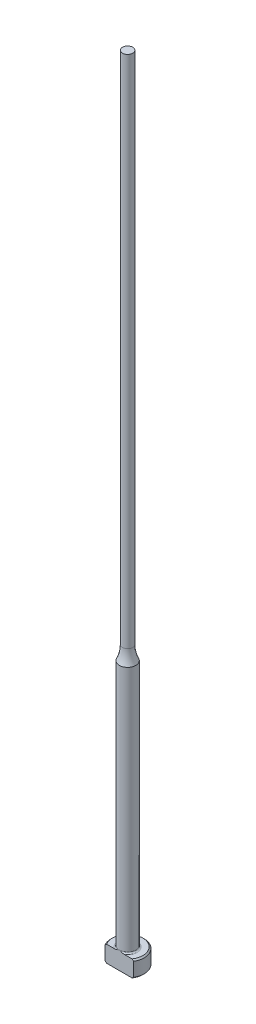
ISO-10303-21;
HEADER;
FILE_DESCRIPTION(('STEP AP214'),'2;1');
FILE_NAME('part.step','',(''),(''),'','','');
FILE_SCHEMA(('AUTOMOTIVE_DESIGN { 1 0 10303 214 1 1 1 1 }'));
ENDSEC;
DATA;
#1=APPLICATION_CONTEXT('core data for automotive mechanical design processes');
#2=APPLICATION_PROTOCOL_DEFINITION('international standard','automotive_design',2000,#1);
#3=PRODUCT_CONTEXT('',#1,'mechanical');
#4=PRODUCT('Part','Part','',(#3));
#5=PRODUCT_RELATED_PRODUCT_CATEGORY('part','',(#4));
#6=PRODUCT_DEFINITION_FORMATION('','',#4);
#7=PRODUCT_DEFINITION_CONTEXT('part definition',#1,'design');
#8=PRODUCT_DEFINITION('design','',#6,#7);
#9=PRODUCT_DEFINITION_SHAPE('','',#8);
#10=(LENGTH_UNIT() NAMED_UNIT(*) SI_UNIT(.MILLI.,.METRE.));
#11=(NAMED_UNIT(*) PLANE_ANGLE_UNIT() SI_UNIT($,.RADIAN.));
#12=(NAMED_UNIT(*) SI_UNIT($,.STERADIAN.) SOLID_ANGLE_UNIT());
#13=UNCERTAINTY_MEASURE_WITH_UNIT(LENGTH_MEASURE(1.E-05),#10,'distance_accuracy_value','');
#14=(GEOMETRIC_REPRESENTATION_CONTEXT(3) GLOBAL_UNCERTAINTY_ASSIGNED_CONTEXT((#13)) GLOBAL_UNIT_ASSIGNED_CONTEXT((#10,
#11,#12)) REPRESENTATION_CONTEXT('',''));
#15=CARTESIAN_POINT('',(0.,0.,0.));
#16=DIRECTION('',(0.,0.,1.));
#17=DIRECTION('',(1.,0.,0.));
#18=AXIS2_PLACEMENT_3D('',#15,#16,#17);
#19=CARTESIAN_POINT('',(-0.991869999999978,152.4,0.));
#20=DIRECTION('',(0.,1.,0.));
#21=DIRECTION('',(0.,0.,1.));
#22=AXIS2_PLACEMENT_3D('',#19,#20,#21);
#23=PLANE('',#22);
#24=CARTESIAN_POINT('',(0.,152.4,0.));
#25=DIRECTION('',(0.,1.,0.));
#26=DIRECTION('',(0.,0.,1.));
#27=AXIS2_PLACEMENT_3D('',#24,#25,#26);
#28=CIRCLE('',#27,0.991869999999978);
#29=CARTESIAN_POINT('',(0.,152.4,0.991869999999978));
#30=VERTEX_POINT('',#29);
#31=EDGE_CURVE('E169',#30,#30,#28,.T.);
#32=ORIENTED_EDGE('',*,*,#31,.T.);
#33=EDGE_LOOP('',(#32));
#34=FACE_BOUND('',#33,.T.);
#35=ADVANCED_FACE('F37',(#34),#23,.T.);
#36=CARTESIAN_POINT('',(0.,259.958771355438,0.));
#37=DIRECTION('',(0.,1.,0.));
#38=DIRECTION('',(0.,0.,1.));
#39=AXIS2_PLACEMENT_3D('',#36,#37,#38);
#40=CYLINDRICAL_SURFACE('',#39,0.991869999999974);
#41=CARTESIAN_POINT('',(0.,53.4850932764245,0.));
#42=DIRECTION('',(0.,1.,0.));
#43=DIRECTION('',(0.,0.,1.));
#44=AXIS2_PLACEMENT_3D('',#41,#42,#43);
#45=CIRCLE('',#44,0.991869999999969);
#46=CARTESIAN_POINT('',(0.,53.4850932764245,0.991869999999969));
#47=VERTEX_POINT('',#46);
#48=EDGE_CURVE('E172',#47,#47,#45,.T.);
#49=ORIENTED_EDGE('',*,*,#48,.T.);
#50=EDGE_LOOP('',(#49));
#51=FACE_BOUND('',#50,.T.);
#52=ORIENTED_EDGE('',*,*,#31,.F.);
#53=EDGE_LOOP('',(#52));
#54=FACE_BOUND('',#53,.T.);
#55=ADVANCED_FACE('F160',(#51,#54),#40,.T.);
#56=CARTESIAN_POINT('',(0.,53.4850932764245,0.));
#57=DIRECTION('',(0.,1.,0.));
#58=DIRECTION('',(0.,0.,1.));
#59=AXIS2_PLACEMENT_3D('',#56,#57,#58);
#60=TOROIDAL_SURFACE('',#59,7.34186999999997,6.35);
#61=CARTESIAN_POINT('',(0.,50.8,0.));
#62=DIRECTION('',(0.,1.,0.));
#63=DIRECTION('',(0.,0.,1.));
#64=AXIS2_PLACEMENT_3D('',#61,#62,#63);
#65=CIRCLE('',#64,1.58749999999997);
#66=CARTESIAN_POINT('',(0.,50.8,1.58749999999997));
#67=VERTEX_POINT('',#66);
#68=EDGE_CURVE('E100',#67,#67,#65,.T.);
#69=ORIENTED_EDGE('',*,*,#68,.T.);
#70=EDGE_LOOP('',(#69));
#71=FACE_BOUND('',#70,.T.);
#72=ORIENTED_EDGE('',*,*,#48,.F.);
#73=EDGE_LOOP('',(#72));
#74=FACE_BOUND('',#73,.T.);
#75=ADVANCED_FACE('F165',(#71,#74),#60,.F.);
#76=CARTESIAN_POINT('',(0.,259.958771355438,0.));
#77=DIRECTION('',(0.,1.,0.));
#78=DIRECTION('',(0.,0.,1.));
#79=AXIS2_PLACEMENT_3D('',#76,#77,#78);
#80=CYLINDRICAL_SURFACE('',#79,1.58749999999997);
#81=CARTESIAN_POINT('',(0.,3.42900000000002,0.));
#82=DIRECTION('',(0.,1.,0.));
#83=DIRECTION('',(0.,0.,1.));
#84=AXIS2_PLACEMENT_3D('',#81,#82,#83);
#85=CIRCLE('',#84,1.58749999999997);
#86=CARTESIAN_POINT('',(0.,3.42900000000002,1.58749999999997));
#87=VERTEX_POINT('',#86);
#88=EDGE_CURVE('E109',#87,#87,#85,.T.);
#89=ORIENTED_EDGE('',*,*,#88,.T.);
#90=EDGE_LOOP('',(#89));
#91=FACE_BOUND('',#90,.T.);
#92=ORIENTED_EDGE('',*,*,#68,.F.);
#93=EDGE_LOOP('',(#92));
#94=FACE_BOUND('',#93,.T.);
#95=ADVANCED_FACE('F192',(#91,#94),#80,.T.);
#96=CARTESIAN_POINT('',(-3.17499999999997,3.175,0.));
#97=DIRECTION('',(0.,1.,0.));
#98=DIRECTION('',(0.,0.,1.));
#99=AXIS2_PLACEMENT_3D('',#96,#97,#98);
#100=PLANE('',#99);
#101=DIRECTION('',(-1.,0.,0.));
#102=VECTOR('',#101,1.);
#103=CARTESIAN_POINT('',(-3.17499999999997,3.175,1.58749999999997));
#104=LINE('',#103,#102);
#105=CARTESIAN_POINT('',(2.45195529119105,3.175,1.58749999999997));
#106=VERTEX_POINT('',#105);
#107=CARTESIAN_POINT('',(0.933255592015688,3.175,1.58749999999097));
#108=VERTEX_POINT('',#107);
#109=EDGE_CURVE('E58',#106,#108,#104,.T.);
#110=ORIENTED_EDGE('',*,*,#109,.F.);
#111=CARTESIAN_POINT('',(0.,3.175,0.));
#112=DIRECTION('',(0.,1.,0.));
#113=DIRECTION('',(0.,0.,1.));
#114=AXIS2_PLACEMENT_3D('',#111,#112,#113);
#115=CIRCLE('',#114,2.92099999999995);
#116=CARTESIAN_POINT('',(-2.45195529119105,3.175,1.58749999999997));
#117=VERTEX_POINT('',#116);
#118=EDGE_CURVE('E171',#106,#117,#115,.T.);
#119=ORIENTED_EDGE('',*,*,#118,.T.);
#120=CARTESIAN_POINT('',(-0.933255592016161,3.17500000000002,1.58749999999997));
#121=VERTEX_POINT('',#120);
#122=EDGE_CURVE('E140',#121,#117,#104,.T.);
#123=ORIENTED_EDGE('',*,*,#122,.F.);
#124=CARTESIAN_POINT('',(0.,3.175,0.));
#125=DIRECTION('',(0.,1.,0.));
#126=DIRECTION('',(0.,0.,1.));
#127=AXIS2_PLACEMENT_3D('',#124,#125,#126);
#128=CIRCLE('',#127,1.84149999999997);
#129=EDGE_CURVE('E113',#121,#108,#128,.F.);
#130=ORIENTED_EDGE('',*,*,#129,.T.);
#131=EDGE_LOOP('',(#110,#119,#123,#130));
#132=FACE_BOUND('',#131,.T.);
#133=ADVANCED_FACE('F189',(#132),#100,.T.);
#134=CARTESIAN_POINT('',(0.,259.958771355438,0.));
#135=DIRECTION('',(0.,1.,0.));
#136=DIRECTION('',(0.,0.,1.));
#137=AXIS2_PLACEMENT_3D('',#134,#135,#136);
#138=CYLINDRICAL_SURFACE('',#137,3.17499999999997);
#139=DIRECTION('',(0.,-1.,0.));
#140=VECTOR('',#139,1.);
#141=CARTESIAN_POINT('',(-2.74963065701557,152.4,1.58749999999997));
#142=LINE('',#141,#140);
#143=CARTESIAN_POINT('',(-2.74963065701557,2.921,1.58749999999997));
#144=VERTEX_POINT('',#143);
#145=CARTESIAN_POINT('',(-2.74963065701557,0.254000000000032,1.58749999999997));
#146=VERTEX_POINT('',#145);
#147=EDGE_CURVE('E95',#144,#146,#142,.T.);
#148=ORIENTED_EDGE('',*,*,#147,.F.);
#149=CARTESIAN_POINT('',(0.,2.92100000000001,0.));
#150=DIRECTION('',(0.,1.,0.));
#151=DIRECTION('',(0.,0.,1.));
#152=AXIS2_PLACEMENT_3D('',#149,#150,#151);
#153=CIRCLE('',#152,3.17499999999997);
#154=CARTESIAN_POINT('',(2.74963065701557,2.921,1.58749999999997));
#155=VERTEX_POINT('',#154);
#156=EDGE_CURVE('E110',#144,#155,#153,.F.);
#157=ORIENTED_EDGE('',*,*,#156,.T.);
#158=DIRECTION('',(0.,-1.,0.));
#159=VECTOR('',#158,1.);
#160=CARTESIAN_POINT('',(2.74963065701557,152.4,1.58749999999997));
#161=LINE('',#160,#159);
#162=CARTESIAN_POINT('',(2.74963065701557,0.254000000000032,1.58749999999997));
#163=VERTEX_POINT('',#162);
#164=EDGE_CURVE('E182',#155,#163,#161,.T.);
#165=ORIENTED_EDGE('',*,*,#164,.T.);
#166=CARTESIAN_POINT('',(0.,0.254000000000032,0.));
#167=DIRECTION('',(0.,-1.,0.));
#168=DIRECTION('',(0.,0.,-1.));
#169=AXIS2_PLACEMENT_3D('',#166,#167,#168);
#170=CIRCLE('',#169,3.17499999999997);
#171=EDGE_CURVE('E116',#163,#146,#170,.F.);
#172=ORIENTED_EDGE('',*,*,#171,.T.);
#173=EDGE_LOOP('',(#148,#157,#165,#172));
#174=FACE_BOUND('',#173,.T.);
#175=ADVANCED_FACE('F180',(#174),#138,.T.);
#176=CARTESIAN_POINT('',(0.,0.,0.));
#177=DIRECTION('',(0.,-1.,0.));
#178=DIRECTION('',(0.,0.,-1.));
#179=AXIS2_PLACEMENT_3D('',#176,#177,#178);
#180=PLANE('',#179);
#181=DIRECTION('',(1.,0.,0.));
#182=VECTOR('',#181,1.);
#183=CARTESIAN_POINT('',(-2.74963065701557,0.,1.58749999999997));
#184=LINE('',#183,#182);
#185=CARTESIAN_POINT('',(-2.45195529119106,0.,1.58749999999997));
#186=VERTEX_POINT('',#185);
#187=CARTESIAN_POINT('',(2.45195529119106,0.,1.58749999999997));
#188=VERTEX_POINT('',#187);
#189=EDGE_CURVE('E92',#186,#188,#184,.T.);
#190=ORIENTED_EDGE('',*,*,#189,.F.);
#191=CARTESIAN_POINT('',(0.,0.,0.));
#192=DIRECTION('',(0.,-1.,0.));
#193=DIRECTION('',(0.,0.,-1.));
#194=AXIS2_PLACEMENT_3D('',#191,#192,#193);
#195=CIRCLE('',#194,2.92099999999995);
#196=EDGE_CURVE('E106',#186,#188,#195,.T.);
#197=ORIENTED_EDGE('',*,*,#196,.T.);
#198=EDGE_LOOP('',(#190,#197));
#199=FACE_BOUND('',#198,.T.);
#200=ADVANCED_FACE('F105',(#199),#180,.T.);
#201=CARTESIAN_POINT('',(0.,3.17499999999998,0.));
#202=DIRECTION('',(0.,-1.,0.));
#203=DIRECTION('',(0.,0.,-1.));
#204=AXIS2_PLACEMENT_3D('',#201,#202,#203);
#205=CONICAL_SURFACE('',#204,2.92099999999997,0.7853981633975);
#206=CARTESIAN_POINT('',(2.75033065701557,2.9203937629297,1.58749999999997));
#207=CARTESIAN_POINT('',(2.66887796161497,2.99091042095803,1.58749999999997));
#208=CARTESIAN_POINT('',(2.58705989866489,3.0610138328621,1.58749999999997));
#209=CARTESIAN_POINT('',(2.42241022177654,3.20009957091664,1.58749999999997));
#210=CARTESIAN_POINT('',(2.33957813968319,3.26908134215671,1.58749999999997));
#211=CARTESIAN_POINT('',(2.17073968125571,3.40716024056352,1.58749999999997));
#212=CARTESIAN_POINT('',(2.08470440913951,3.47622217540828,1.58749999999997));
#213=CARTESIAN_POINT('',(1.91099881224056,3.61222325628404,1.58749999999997));
#214=CARTESIAN_POINT('',(1.82332890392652,3.67916293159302,1.58749999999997));
#215=CARTESIAN_POINT('',(1.64569223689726,3.81020667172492,1.58749999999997));
#216=CARTESIAN_POINT('',(1.55572245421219,3.87430666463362,1.58749999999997));
#217=CARTESIAN_POINT('',(1.37280394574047,3.99833089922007,1.58749999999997));
#218=CARTESIAN_POINT('',(1.27985285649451,4.05825170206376,1.58749999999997));
#219=CARTESIAN_POINT('',(1.09086561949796,4.17130826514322,1.58749999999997));
#220=CARTESIAN_POINT('',(0.99485990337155,4.22449421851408,1.58749999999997));
#221=CARTESIAN_POINT('',(0.798114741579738,4.32122233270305,1.58749999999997));
#222=CARTESIAN_POINT('',(0.697384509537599,4.36478238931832,1.58749999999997));
#223=CARTESIAN_POINT('',(0.541185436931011,4.4195165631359,1.58749999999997));
#224=CARTESIAN_POINT('',(0.487627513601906,4.43611950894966,1.58749999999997));
#225=CARTESIAN_POINT('',(0.379267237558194,4.46466012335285,1.58749999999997));
#226=CARTESIAN_POINT('',(0.324465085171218,4.47659853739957,1.58749999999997));
#227=CARTESIAN_POINT('',(0.214272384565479,4.49501904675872,1.58749999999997));
#228=CARTESIAN_POINT('',(0.158887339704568,4.50153345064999,1.58749999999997));
#229=CARTESIAN_POINT('',(0.0477364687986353,4.50875028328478,1.58749999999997));
#230=CARTESIAN_POINT('',(-0.00802931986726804,4.50945327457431,1.58749999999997));
#231=CARTESIAN_POINT('',(-0.119372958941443,4.50499163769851,1.58749999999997));
#232=CARTESIAN_POINT('',(-0.174950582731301,4.49982147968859,1.58749999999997));
#233=CARTESIAN_POINT('',(-0.285312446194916,4.48399101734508,1.58749999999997));
#234=CARTESIAN_POINT('',(-0.340096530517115,4.47332965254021,1.58749999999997));
#235=CARTESIAN_POINT('',(-0.448865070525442,4.44711334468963,1.58749999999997));
#236=CARTESIAN_POINT('',(-0.50284128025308,4.43152477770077,1.58749999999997));
#237=CARTESIAN_POINT('',(-0.609429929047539,4.39628553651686,1.58749999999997));
#238=CARTESIAN_POINT('',(-0.66204236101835,4.3766348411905,1.58749999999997));
#239=CARTESIAN_POINT('',(-0.778129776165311,4.32902110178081,1.58749999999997));
#240=CARTESIAN_POINT('',(-0.84124591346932,4.30019026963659,1.58749999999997));
#241=CARTESIAN_POINT('',(-0.965594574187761,4.23868811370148,1.58749999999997));
#242=CARTESIAN_POINT('',(-1.02682597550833,4.20601455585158,1.58749999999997));
#243=CARTESIAN_POINT('',(-1.14774341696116,4.13769010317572,1.58749999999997));
#244=CARTESIAN_POINT('',(-1.20742632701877,4.10203371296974,1.58749999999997));
#245=CARTESIAN_POINT('',(-1.32539130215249,4.02846531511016,1.58749999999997));
#246=CARTESIAN_POINT('',(-1.38367308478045,3.9905528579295,1.58749999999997));
#247=CARTESIAN_POINT('',(-1.55734442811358,3.87382704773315,1.58749999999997));
#248=CARTESIAN_POINT('',(-1.67095842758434,3.79237897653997,1.58749999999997));
#249=CARTESIAN_POINT('',(-1.8947523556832,3.6252186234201,1.58749999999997));
#250=CARTESIAN_POINT('',(-2.00493591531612,3.53951111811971,1.58749999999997));
#251=CARTESIAN_POINT('',(-2.22248693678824,3.3655494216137,1.58749999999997));
#252=CARTESIAN_POINT('',(-2.32986450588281,3.27730782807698,1.58749999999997));
#253=CARTESIAN_POINT('',(-2.48909538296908,3.14389342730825,1.58749999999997));
#254=CARTESIAN_POINT('',(-2.54159338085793,3.09948435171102,1.58749999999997));
#255=CARTESIAN_POINT('',(-2.64622282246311,3.01024124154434,1.58749999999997));
#256=CARTESIAN_POINT('',(-2.69835428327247,2.96540722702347,1.58749999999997));
#257=CARTESIAN_POINT('',(-2.75033065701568,2.92039376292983,1.58749999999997));
#258=B_SPLINE_CURVE_WITH_KNOTS('',3,(#206,#207,#208,#209,#210,#211,#212,#213,#214,#215,#216,
#217,#218,#219,#220,#221,#222,#223,#224,#225,#226,#227,#228,#229,#230,#231,#232,#233,#234,#235,
#236,#237,#238,#239,#240,#241,#242,#243,#244,#245,#246,#247,#248,#249,#250,#251,#252,#253,#254,
#255,#256,#257),.UNSPECIFIED.,.F.,.F.,(4,2,2,2,2,2,2,2,2,2,2,2,2,2,2,2,2,2,2,2,2,2,2,2,2,4),(0.,
0.323216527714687,0.64658837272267,0.977539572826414,1.30840757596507,1.63973560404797,
1.97133312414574,2.30029221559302,2.62863448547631,2.79668277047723,2.9647041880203,
3.13171746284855,3.29871457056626,3.46586904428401,3.63305581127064,3.80140905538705,
3.96976317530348,4.17775353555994,4.38586541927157,4.59436953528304,4.80291533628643,
5.22209642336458,5.64081759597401,6.0577303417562,6.26401477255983,6.47028951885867),.UNSPECIFIED.);
#259=EDGE_CURVE('E63',#155,#106,#258,.T.);
#260=ORIENTED_EDGE('',*,*,#259,.F.);
#261=ORIENTED_EDGE('',*,*,#156,.F.);
#262=EDGE_CURVE('E133',#117,#144,#258,.T.);
#263=ORIENTED_EDGE('',*,*,#262,.F.);
#264=ORIENTED_EDGE('',*,*,#118,.F.);
#265=EDGE_LOOP('',(#260,#261,#263,#264));
#266=FACE_BOUND('',#265,.T.);
#267=ADVANCED_FACE('F147',(#266),#205,.T.);
#268=CARTESIAN_POINT('',(0.,0.254000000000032,0.));
#269=DIRECTION('',(0.,1.,0.));
#270=DIRECTION('',(0.,0.,1.));
#271=AXIS2_PLACEMENT_3D('',#268,#269,#270);
#272=CONICAL_SURFACE('',#271,3.17499999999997,0.785398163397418);
#273=CARTESIAN_POINT('',(-2.75033065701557,0.254606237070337,1.58749999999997));
#274=CARTESIAN_POINT('',(-2.66887796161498,0.184089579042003,1.58749999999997));
#275=CARTESIAN_POINT('',(-2.58705989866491,0.113986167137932,1.58749999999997));
#276=CARTESIAN_POINT('',(-2.42241022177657,-0.0250995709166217,1.58749999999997));
#277=CARTESIAN_POINT('',(-2.33957813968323,-0.0940813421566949,1.58749999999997));
#278=CARTESIAN_POINT('',(-2.17073968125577,-0.232160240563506,1.58749999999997));
#279=CARTESIAN_POINT('',(-2.08470440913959,-0.301222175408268,1.58749999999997));
#280=CARTESIAN_POINT('',(-1.91099881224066,-0.437223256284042,1.58749999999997));
#281=CARTESIAN_POINT('',(-1.82332890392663,-0.504162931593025,1.58749999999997));
#282=CARTESIAN_POINT('',(-1.64569223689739,-0.635206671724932,1.58749999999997));
#283=CARTESIAN_POINT('',(-1.55572245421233,-0.699306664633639,1.58749999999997));
#284=CARTESIAN_POINT('',(-1.37280394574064,-0.8233308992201,1.58749999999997));
#285=CARTESIAN_POINT('',(-1.27985285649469,-0.883251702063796,1.58749999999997));
#286=CARTESIAN_POINT('',(-1.09086561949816,-0.996308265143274,1.58749999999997));
#287=CARTESIAN_POINT('',(-0.994859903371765,-1.04949421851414,1.58749999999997));
#288=CARTESIAN_POINT('',(-0.798114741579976,-1.14622233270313,1.58749999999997));
#289=CARTESIAN_POINT('',(-0.697384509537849,-1.18978238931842,1.58749999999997));
#290=CARTESIAN_POINT('',(-0.54118543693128,-1.24451656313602,1.58749999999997));
#291=CARTESIAN_POINT('',(-0.487627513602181,-1.26111950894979,1.58749999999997));
#292=CARTESIAN_POINT('',(-0.379267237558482,-1.28966012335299,1.58749999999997));
#293=CARTESIAN_POINT('',(-0.324465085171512,-1.30159853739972,1.58749999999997));
#294=CARTESIAN_POINT('',(-0.214272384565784,-1.3200190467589,1.58749999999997));
#295=CARTESIAN_POINT('',(-0.158887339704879,-1.32653345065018,1.58749999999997));
#296=CARTESIAN_POINT('',(-0.0477364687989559,-1.33375028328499,1.58749999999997));
#297=CARTESIAN_POINT('',(0.00802931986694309,-1.33445327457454,1.58749999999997));
#298=CARTESIAN_POINT('',(0.119372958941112,-1.32999163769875,1.58749999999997));
#299=CARTESIAN_POINT('',(0.174950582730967,-1.32482147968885,1.58749999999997));
#300=CARTESIAN_POINT('',(0.28531244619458,-1.30899101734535,1.58749999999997));
#301=CARTESIAN_POINT('',(0.340096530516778,-1.2983296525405,1.58749999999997));
#302=CARTESIAN_POINT('',(0.448865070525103,-1.27211334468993,1.58749999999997));
#303=CARTESIAN_POINT('',(0.50284128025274,-1.25652477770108,1.58749999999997));
#304=CARTESIAN_POINT('',(0.609429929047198,-1.22128553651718,1.58749999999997));
#305=CARTESIAN_POINT('',(0.662042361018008,-1.20163484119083,1.58749999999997));
#306=CARTESIAN_POINT('',(0.778129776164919,-1.15402110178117,1.58749999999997));
#307=CARTESIAN_POINT('',(0.84124591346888,-1.12519026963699,1.58749999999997));
#308=CARTESIAN_POINT('',(0.965594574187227,-1.06368811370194,1.58749999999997));
#309=CARTESIAN_POINT('',(1.02682597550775,-1.03101455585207,1.58749999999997));
#310=CARTESIAN_POINT('',(1.14774341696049,-0.962690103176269,1.58749999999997));
#311=CARTESIAN_POINT('',(1.20742632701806,-0.927033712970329,1.58749999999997));
#312=CARTESIAN_POINT('',(1.32539130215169,-0.853465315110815,1.58749999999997));
#313=CARTESIAN_POINT('',(1.38367308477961,-0.815552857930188,1.58749999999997));
#314=CARTESIAN_POINT('',(1.5573444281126,-0.698827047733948,1.58749999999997));
#315=CARTESIAN_POINT('',(1.67095842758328,-0.617378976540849,1.58749999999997));
#316=CARTESIAN_POINT('',(1.89475235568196,-0.450218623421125,1.58749999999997));
#317=CARTESIAN_POINT('',(2.0049359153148,-0.364511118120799,1.58749999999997));
#318=CARTESIAN_POINT('',(2.22248693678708,-0.190549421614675,1.58749999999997));
#319=CARTESIAN_POINT('',(2.32986450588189,-0.102307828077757,1.58749999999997));
#320=CARTESIAN_POINT('',(2.48909538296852,0.0311065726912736,1.58749999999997));
#321=CARTESIAN_POINT('',(2.54159338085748,0.0755156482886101,1.58749999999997));
#322=CARTESIAN_POINT('',(2.64622282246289,0.164758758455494,1.58749999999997));
#323=CARTESIAN_POINT('',(2.69835428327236,0.20959277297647,1.58749999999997));
#324=CARTESIAN_POINT('',(2.75033065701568,0.25460623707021,1.58749999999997));
#325=B_SPLINE_CURVE_WITH_KNOTS('',3,(#273,#274,#275,#276,#277,#278,#279,#280,#281,#282,#283,
#284,#285,#286,#287,#288,#289,#290,#291,#292,#293,#294,#295,#296,#297,#298,#299,#300,#301,#302,
#303,#304,#305,#306,#307,#308,#309,#310,#311,#312,#313,#314,#315,#316,#317,#318,#319,#320,#321,
#322,#323,#324),.UNSPECIFIED.,.F.,.F.,(4,2,2,2,2,2,2,2,2,2,2,2,2,2,2,2,2,2,2,2,2,2,2,2,2,4),(0.,
0.323216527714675,0.646588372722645,0.977539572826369,1.308407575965,1.63973560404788,
1.97133312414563,2.3002922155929,2.62863448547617,2.79668277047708,2.96470418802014,
3.13171746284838,3.29871457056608,3.46586904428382,3.63305581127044,3.80140905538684,
3.96976317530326,4.17775353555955,4.38586541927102,4.59436953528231,4.80291533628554,
5.22209642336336,5.64081759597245,6.05773034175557,6.26401477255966,6.47028951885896),.UNSPECIFIED.);
#326=EDGE_CURVE('E89',#146,#186,#325,.T.);
#327=ORIENTED_EDGE('',*,*,#326,.F.);
#328=ORIENTED_EDGE('',*,*,#171,.F.);
#329=EDGE_CURVE('E101',#188,#163,#325,.T.);
#330=ORIENTED_EDGE('',*,*,#329,.F.);
#331=ORIENTED_EDGE('',*,*,#196,.F.);
#332=EDGE_LOOP('',(#327,#328,#330,#331));
#333=FACE_BOUND('',#332,.T.);
#334=ADVANCED_FACE('F108',(#333),#272,.T.);
#335=CARTESIAN_POINT('',(0.,3.42900000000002,0.));
#336=DIRECTION('',(0.,1.,0.));
#337=DIRECTION('',(0.,0.,1.));
#338=AXIS2_PLACEMENT_3D('',#335,#336,#337);
#339=TOROIDAL_SURFACE('',#338,1.84149999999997,0.254);
#340=ORIENTED_EDGE('',*,*,#129,.F.);
#341=CARTESIAN_POINT('',(0.,3.42900000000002,1.58749999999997));
#342=CARTESIAN_POINT('',(-1.9220500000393E-10,3.42900057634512,1.58749999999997));
#343=CARTESIAN_POINT('',(-1.22611614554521E-07,3.42900115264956,1.58749999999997));
#344=CARTESIAN_POINT('',(-5.09676364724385E-07,3.42900226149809,1.58749999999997));
#345=CARTESIAN_POINT('',(-7.78176327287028E-07,3.42900279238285,1.58749999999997));
#346=CARTESIAN_POINT('',(-1.42307272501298E-06,3.42900385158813,1.58749999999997));
#347=CARTESIAN_POINT('',(-1.80713867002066E-06,3.42900437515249,1.58749999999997));
#348=CARTESIAN_POINT('',(-2.63494846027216E-06,3.42900536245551,1.58749999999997));
#349=CARTESIAN_POINT('',(-3.07814756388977E-06,3.42900582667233,1.58749999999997));
#350=CARTESIAN_POINT('',(-4.66897357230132E-06,3.42900738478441,1.58749999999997));
#351=CARTESIAN_POINT('',(-5.89404907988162E-06,3.42900840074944,1.58749999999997));
#352=CARTESIAN_POINT('',(-8.42427510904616E-06,3.42901020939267,1.58749999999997));
#353=CARTESIAN_POINT('',(-9.72480574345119E-06,3.42901100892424,1.58749999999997));
#354=CARTESIAN_POINT('',(-1.48060601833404E-05,3.42901401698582,1.58749999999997));
#355=CARTESIAN_POINT('',(-1.86838281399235E-05,3.42901606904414,1.58749999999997));
#356=CARTESIAN_POINT('',(-2.63261117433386E-05,3.42901942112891,1.58749999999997));
#357=CARTESIAN_POINT('',(-3.0068741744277E-05,3.42902077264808,1.58749999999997));
#358=CARTESIAN_POINT('',(-4.60276298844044E-05,3.42902652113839,1.58749999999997));
#359=CARTESIAN_POINT('',(-5.82470198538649E-05,3.42903088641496,1.58749999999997));
#360=CARTESIAN_POINT('',(-8.11070097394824E-05,3.42903788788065,1.58749999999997));
#361=CARTESIAN_POINT('',(-9.16953114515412E-05,3.42904068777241,1.58749999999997));
#362=CARTESIAN_POINT('',(-0.000168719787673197,3.42906287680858,1.58749999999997));
#363=CARTESIAN_POINT('',(-0.000232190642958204,3.4290911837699,1.58749999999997));
#364=CARTESIAN_POINT('',(-0.000479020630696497,3.42919723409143,1.58749999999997));
#365=CARTESIAN_POINT('',(-0.000664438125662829,3.42926834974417,1.58749999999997));
#366=CARTESIAN_POINT('',(-0.0013844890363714,3.42954862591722,1.58749999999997));
#367=CARTESIAN_POINT('',(-0.00191701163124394,3.42976473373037,1.58749999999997));
#368=CARTESIAN_POINT('',(-0.00409774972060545,3.4306455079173,1.58749999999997));
#369=CARTESIAN_POINT('',(-0.00574830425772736,3.43130231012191,1.58749999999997));
#370=CARTESIAN_POINT('',(-0.0289985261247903,3.4405594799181,1.58749999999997));
#371=CARTESIAN_POINT('',(-0.0505816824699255,3.4492167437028,1.58749999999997));
#372=CARTESIAN_POINT('',(-0.0929947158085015,3.46610702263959,1.58749999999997));
#373=CARTESIAN_POINT('',(-0.113823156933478,3.47434394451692,1.58749999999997));
#374=CARTESIAN_POINT('',(-0.157956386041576,3.49164606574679,1.58749999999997));
#375=CARTESIAN_POINT('',(-0.181267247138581,3.50069608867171,1.58749999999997));
#376=CARTESIAN_POINT('',(-0.228222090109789,3.51863224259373,1.58749999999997));
#377=CARTESIAN_POINT('',(-0.25186705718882,3.52751579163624,1.58749999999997));
#378=CARTESIAN_POINT('',(-0.310512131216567,3.54905503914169,1.58749999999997));
#379=CARTESIAN_POINT('',(-0.345588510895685,3.56150550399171,1.58749999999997));
#380=CARTESIAN_POINT('',(-0.415278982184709,3.5850302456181,1.58749999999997));
#381=CARTESIAN_POINT('',(-0.449884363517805,3.59613012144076,1.58749999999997));
#382=CARTESIAN_POINT('',(-0.524471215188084,3.61841679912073,1.58749999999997));
#383=CARTESIAN_POINT('',(-0.564517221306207,3.62939137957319,1.58749999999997));
#384=CARTESIAN_POINT('',(-0.645529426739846,3.6489746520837,1.58749999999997));
#385=CARTESIAN_POINT('',(-0.686500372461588,3.65756417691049,1.58749999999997));
#386=CARTESIAN_POINT('',(-0.771546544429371,3.67188287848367,1.58749999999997));
#387=CARTESIAN_POINT('',(-0.815658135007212,3.67740449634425,1.58749999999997));
#388=CARTESIAN_POINT('',(-0.904117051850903,3.68344603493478,1.58749999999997));
#389=CARTESIAN_POINT('',(-0.948462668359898,3.68398638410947,1.58749999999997));
#390=CARTESIAN_POINT('',(-1.02531896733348,3.67901051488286,1.58749999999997));
#391=CARTESIAN_POINT('',(-1.05792141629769,3.67502604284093,1.58749999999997));
#392=CARTESIAN_POINT('',(-1.12184393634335,3.66230832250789,1.58749999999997));
#393=CARTESIAN_POINT('',(-1.1531753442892,3.65363950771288,1.58749999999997));
#394=CARTESIAN_POINT('',(-1.19946468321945,3.6356384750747,1.58749999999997));
#395=CARTESIAN_POINT('',(-1.21526783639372,3.62848492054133,1.58749999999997));
#396=CARTESIAN_POINT('',(-1.24583726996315,3.61212937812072,1.58749999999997));
#397=CARTESIAN_POINT('',(-1.26060215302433,3.60292469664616,1.58749999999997));
#398=CARTESIAN_POINT('',(-1.28575815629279,3.58421518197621,1.58749999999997));
#399=CARTESIAN_POINT('',(-1.29644383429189,3.57510998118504,1.58749999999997));
#400=CARTESIAN_POINT('',(-1.31623154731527,3.55531539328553,1.58749999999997));
#401=CARTESIAN_POINT('',(-1.32533681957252,3.54462932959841,1.58749999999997));
#402=CARTESIAN_POINT('',(-1.33941140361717,3.52450022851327,1.58749999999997));
#403=CARTESIAN_POINT('',(-1.34484814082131,3.51538553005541,1.58749999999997));
#404=CARTESIAN_POINT('',(-1.35416329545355,3.49638544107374,1.58749999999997));
#405=CARTESIAN_POINT('',(-1.35804267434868,3.48650053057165,1.58749999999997));
#406=CARTESIAN_POINT('',(-1.36398436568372,3.46611321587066,1.58749999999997));
#407=CARTESIAN_POINT('',(-1.36603350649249,3.45560690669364,1.58749999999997));
#408=CARTESIAN_POINT('',(-1.3680840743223,3.43439627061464,1.58749999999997));
#409=CARTESIAN_POINT('',(-1.36808648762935,3.42369204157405,1.58749999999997));
#410=CARTESIAN_POINT('',(-1.36616208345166,3.40366716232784,1.58749999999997));
#411=CARTESIAN_POINT('',(-1.36444960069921,3.39432493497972,1.58749999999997));
#412=CARTESIAN_POINT('',(-1.35953338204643,3.37604480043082,1.58749999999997));
#413=CARTESIAN_POINT('',(-1.3563294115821,3.36710695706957,1.58749999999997));
#414=CARTESIAN_POINT('',(-1.34848006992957,3.34949697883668,1.58749999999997));
#415=CARTESIAN_POINT('',(-1.34378578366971,3.34084688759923,1.58749999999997));
#416=CARTESIAN_POINT('',(-1.33324445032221,3.32428742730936,1.58749999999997));
#417=CARTESIAN_POINT('',(-1.32739692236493,3.31637836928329,1.58749999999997));
#418=CARTESIAN_POINT('',(-1.31107304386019,3.29692878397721,1.58749999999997));
#419=CARTESIAN_POINT('',(-1.29989286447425,3.28597778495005,1.58749999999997));
#420=CARTESIAN_POINT('',(-1.27593566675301,3.26597490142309,1.58749999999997));
#421=CARTESIAN_POINT('',(-1.2631537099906,3.25692913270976,1.58749999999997));
#422=CARTESIAN_POINT('',(-1.22930733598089,3.23613976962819,1.58749999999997));
#423=CARTESIAN_POINT('',(-1.20751096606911,3.22559415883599,1.58749999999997));
#424=CARTESIAN_POINT('',(-1.16266144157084,3.20795356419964,1.58749999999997));
#425=CARTESIAN_POINT('',(-1.13960937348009,3.20085564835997,1.58749999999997));
#426=CARTESIAN_POINT('',(-1.07603916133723,3.18534571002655,1.58749999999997));
#427=CARTESIAN_POINT('',(-1.03486686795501,3.17965078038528,1.58749999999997));
#428=CARTESIAN_POINT('',(-0.951558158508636,3.1741711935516,1.58749999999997));
#429=CARTESIAN_POINT('',(-0.909417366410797,3.17449023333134,1.58749999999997));
#430=CARTESIAN_POINT('',(-0.811383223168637,3.18054602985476,1.58749999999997));
#431=CARTESIAN_POINT('',(-0.755610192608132,3.18806126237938,1.58749999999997));
#432=CARTESIAN_POINT('',(-0.644937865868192,3.20866626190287,1.58749999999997));
#433=CARTESIAN_POINT('',(-0.590043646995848,3.2217810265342,1.58749999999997));
#434=CARTESIAN_POINT('',(-0.485757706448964,3.25059077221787,1.58749999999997));
#435=CARTESIAN_POINT('',(-0.436281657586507,3.2659890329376,1.58749999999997));
#436=CARTESIAN_POINT('',(-0.338551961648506,3.29877502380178,1.58749999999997));
#437=CARTESIAN_POINT('',(-0.290291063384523,3.31614156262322,1.58749999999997));
#438=CARTESIAN_POINT('',(-0.225557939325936,3.34039762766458,1.58749999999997));
#439=CARTESIAN_POINT('',(-0.208874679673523,3.34673586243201,1.58749999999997));
#440=CARTESIAN_POINT('',(-0.175123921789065,3.35969957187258,1.58749999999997));
#441=CARTESIAN_POINT('',(-0.158057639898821,3.36632823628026,1.58749999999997));
#442=CARTESIAN_POINT('',(-0.117638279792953,3.38214476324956,1.58749999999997));
#443=CARTESIAN_POINT('',(-0.0943002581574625,3.39137029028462,1.58749999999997));
#444=CARTESIAN_POINT('',(-0.049782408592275,3.40910304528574,1.58749999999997));
#445=CARTESIAN_POINT('',(-0.028598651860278,3.41759960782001,1.58749999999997));
#446=CARTESIAN_POINT('',(-0.00575168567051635,3.42669635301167,1.58749999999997));
#447=CARTESIAN_POINT('',(-0.00410451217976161,3.42735181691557,1.58749999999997));
#448=CARTESIAN_POINT('',(-0.00192459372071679,3.42823223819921,1.58749999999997));
#449=CARTESIAN_POINT('',(-0.00138952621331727,3.42844937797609,1.58749999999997));
#450=CARTESIAN_POINT('',(-0.000666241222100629,3.42873091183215,1.58749999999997));
#451=CARTESIAN_POINT('',(-0.000480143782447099,3.42880228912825,1.58749999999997));
#452=CARTESIAN_POINT('',(-0.000232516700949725,3.4289086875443,1.58749999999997));
#453=CARTESIAN_POINT('',(-0.00016892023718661,3.42893705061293,1.58749999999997));
#454=CARTESIAN_POINT('',(-9.17527161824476E-05,3.42895927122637,1.58749999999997));
#455=CARTESIAN_POINT('',(-8.11550293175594E-05,3.42896207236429,1.58749999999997));
#456=CARTESIAN_POINT('',(-5.82743948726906E-05,3.4289690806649,1.58749999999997));
#457=CARTESIAN_POINT('',(-4.60440001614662E-05,3.4289734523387,1.58749999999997));
#458=CARTESIAN_POINT('',(-3.00727682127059E-05,3.42897920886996,1.58749999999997));
#459=CARTESIAN_POINT('',(-2.63286807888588E-05,3.42898056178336,1.58749999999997));
#460=CARTESIAN_POINT('',(-1.86836529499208E-05,3.42898391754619,1.58749999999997));
#461=CARTESIAN_POINT('',(-1.48046517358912E-05,3.42898597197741,1.58749999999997));
#462=CARTESIAN_POINT('',(-9.72223943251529E-06,3.42898898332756,1.58749999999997));
#463=CARTESIAN_POINT('',(-8.4215964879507E-06,3.4289897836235,1.58749999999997));
#464=CARTESIAN_POINT('',(-5.89129728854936E-06,3.428991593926,1.58749999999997));
#465=CARTESIAN_POINT('',(-4.66626866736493E-06,3.42899261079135,1.58749999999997));
#466=CARTESIAN_POINT('',(-3.07568803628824E-06,3.42899417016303,1.58749999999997));
#467=CARTESIAN_POINT('',(-2.63259565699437E-06,3.42899463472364,1.58749999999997));
#468=CARTESIAN_POINT('',(-1.80506085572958E-06,3.42899562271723,1.58749999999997));
#469=CARTESIAN_POINT('',(-1.42116387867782E-06,3.4289961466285,1.58749999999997));
#470=CARTESIAN_POINT('',(-7.76675642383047E-07,3.42899720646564,1.58749999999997));
#471=CARTESIAN_POINT('',(-5.08406487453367E-07,3.42899773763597,1.58749999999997));
#472=CARTESIAN_POINT('',(-1.21901887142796E-07,3.42899884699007,1.58749999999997));
#473=CARTESIAN_POINT('',(1.92251529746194E-10,3.42899942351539,1.58749999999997));
#474=CARTESIAN_POINT('',(0.,3.42900000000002,1.58749999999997));
#475=B_SPLINE_CURVE_WITH_KNOTS('',3,(#341,#342,#343,#344,#345,#346,#347,#348,#349,#350,#351,
#352,#353,#354,#355,#356,#357,#358,#359,#360,#361,#362,#363,#364,#365,#366,#367,#368,#369,#370,
#371,#372,#373,#374,#375,#376,#377,#378,#379,#380,#381,#382,#383,#384,#385,#386,#387,#388,#389,
#390,#391,#392,#393,#394,#395,#396,#397,#398,#399,#400,#401,#402,#403,#404,#405,#406,#407,#408,
#409,#410,#411,#412,#413,#414,#415,#416,#417,#418,#419,#420,#421,#422,#423,#424,#425,#426,#427,
#428,#429,#430,#431,#432,#433,#434,#435,#436,#437,#438,#439,#440,#441,#442,#443,#444,#445,#446,
#447,#448,#449,#450,#451,#452,#453,#454,#455,#456,#457,#458,#459,#460,#461,#462,#463,#464,#465,
#466,#467,#468,#469,#470,#471,#472,#473,#474),.UNSPECIFIED.,.T.,.F.,(4,2,2,2,2,2,2,2,2,2,2,2,2,
2,2,2,2,2,2,2,2,2,2,2,2,2,2,2,2,2,2,2,2,2,2,2,2,2,2,2,2,2,2,2,2,2,2,2,2,2,2,2,2,2,2,2,2,2,2,2,2,
2,2,2,2,2,4),(0.,1.72815459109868E-06,3.50429256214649E-06,5.44431005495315E-06,
7.36755250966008E-06,1.21190896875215E-05,1.66953775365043E-05,2.98160400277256E-05,
4.17409564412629E-05,8.06604753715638E-05,0.000113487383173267,0.000321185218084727,
0.000917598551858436,0.00264089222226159,0.00797105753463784,0.0777276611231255,
0.144923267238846,0.219939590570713,0.295714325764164,0.407362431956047,0.516367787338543,
0.640878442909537,0.766362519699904,0.899536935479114,1.03216495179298,1.130457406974,
1.22743103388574,1.27935899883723,1.33135556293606,1.3733324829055,1.41522237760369,
1.44693946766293,1.47863694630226,1.51056074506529,1.54246916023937,1.57083210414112,
1.59919951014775,1.62861579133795,1.65804436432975,1.70472658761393,1.75155645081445,
1.82378709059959,1.89595619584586,2.01995471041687,2.14609321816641,2.31447224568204,
2.4836109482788,2.63898919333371,2.79283011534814,2.8463703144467,2.90129461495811,
2.9765823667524,3.04504771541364,3.05036697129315,3.0520984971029,3.0526970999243,
3.05290520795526,3.05293806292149,3.05297701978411,3.05298895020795,3.05300207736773,
3.05300665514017,3.05301140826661,3.0530133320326,3.05301527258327,3.05301704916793,
3.05301877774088),.UNSPECIFIED.);
#476=EDGE_CURVE('E11',#121,#87,#475,.T.);
#477=ORIENTED_EDGE('',*,*,#476,.T.);
#478=ORIENTED_EDGE('',*,*,#88,.F.);
#479=CARTESIAN_POINT('',(0.,3.42900000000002,1.58749999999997));
#480=CARTESIAN_POINT('',(1.92205030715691E-10,3.42899942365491,1.58749999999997));
#481=CARTESIAN_POINT('',(1.22611614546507E-07,3.42899884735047,1.58749999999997));
#482=CARTESIAN_POINT('',(5.09676364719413E-07,3.42899773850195,1.58749999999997));
#483=CARTESIAN_POINT('',(7.78176327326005E-07,3.42899720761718,1.58749999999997));
#484=CARTESIAN_POINT('',(1.42307272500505E-06,3.4289961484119,1.58749999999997));
#485=CARTESIAN_POINT('',(1.80713866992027E-06,3.42899562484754,1.58749999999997));
#486=CARTESIAN_POINT('',(2.63494846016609E-06,3.42899463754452,1.58749999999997));
#487=CARTESIAN_POINT('',(3.07814756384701E-06,3.4289941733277,1.58749999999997));
#488=CARTESIAN_POINT('',(4.66897357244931E-06,3.42899261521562,1.58749999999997));
#489=CARTESIAN_POINT('',(5.89404907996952E-06,3.42899159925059,1.58749999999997));
#490=CARTESIAN_POINT('',(8.42427510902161E-06,3.42898979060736,1.58749999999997));
#491=CARTESIAN_POINT('',(9.72480574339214E-06,3.42898899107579,1.58749999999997));
#492=CARTESIAN_POINT('',(1.48060601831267E-05,3.42898598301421,1.58749999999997));
#493=CARTESIAN_POINT('',(1.86838281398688E-05,3.42898393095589,1.58749999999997));
#494=CARTESIAN_POINT('',(2.63261117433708E-05,3.42898057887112,1.58749999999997));
#495=CARTESIAN_POINT('',(3.00687417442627E-05,3.42897922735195,1.58749999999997));
#496=CARTESIAN_POINT('',(4.6027629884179E-05,3.42897347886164,1.58749999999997));
#497=CARTESIAN_POINT('',(5.82470198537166E-05,3.42896911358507,1.58749999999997));
#498=CARTESIAN_POINT('',(8.1107009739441E-05,3.42896211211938,1.58749999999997));
#499=CARTESIAN_POINT('',(9.16953114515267E-05,3.42895931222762,1.58749999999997));
#500=CARTESIAN_POINT('',(0.00016871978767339,3.42893712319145,1.58749999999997));
#501=CARTESIAN_POINT('',(0.000232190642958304,3.42890881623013,1.58749999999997));
#502=CARTESIAN_POINT('',(0.000479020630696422,3.4288027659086,1.58749999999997));
#503=CARTESIAN_POINT('',(0.000664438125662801,3.42873165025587,1.58749999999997));
#504=CARTESIAN_POINT('',(0.0013844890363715,3.42845137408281,1.58749999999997));
#505=CARTESIAN_POINT('',(0.00191701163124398,3.42823526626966,1.58749999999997));
#506=CARTESIAN_POINT('',(0.00409774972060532,3.42735449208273,1.58749999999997));
#507=CARTESIAN_POINT('',(0.0057483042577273,3.42669768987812,1.58749999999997));
#508=CARTESIAN_POINT('',(0.028998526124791,3.41744052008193,1.58749999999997));
#509=CARTESIAN_POINT('',(0.0505816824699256,3.40878325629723,1.58749999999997));
#510=CARTESIAN_POINT('',(0.0929947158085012,3.39189297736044,1.58749999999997));
#511=CARTESIAN_POINT('',(0.113823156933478,3.38365605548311,1.58749999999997));
#512=CARTESIAN_POINT('',(0.157956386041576,3.36635393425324,1.58749999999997));
#513=CARTESIAN_POINT('',(0.181267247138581,3.35730391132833,1.58749999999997));
#514=CARTESIAN_POINT('',(0.228222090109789,3.3393677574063,1.58749999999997));
#515=CARTESIAN_POINT('',(0.25186705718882,3.33048420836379,1.58749999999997));
#516=CARTESIAN_POINT('',(0.310512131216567,3.30894496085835,1.58749999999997));
#517=CARTESIAN_POINT('',(0.345588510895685,3.29649449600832,1.58749999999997));
#518=CARTESIAN_POINT('',(0.415278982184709,3.27296975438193,1.58749999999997));
#519=CARTESIAN_POINT('',(0.449884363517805,3.26186987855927,1.58749999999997));
#520=CARTESIAN_POINT('',(0.524471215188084,3.2395832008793,1.58749999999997));
#521=CARTESIAN_POINT('',(0.564517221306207,3.22860862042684,1.58749999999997));
#522=CARTESIAN_POINT('',(0.645529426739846,3.20902534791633,1.58749999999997));
#523=CARTESIAN_POINT('',(0.686500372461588,3.20043582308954,1.58749999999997));
#524=CARTESIAN_POINT('',(0.771546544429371,3.18611712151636,1.58749999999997));
#525=CARTESIAN_POINT('',(0.815658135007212,3.18059550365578,1.58749999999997));
#526=CARTESIAN_POINT('',(0.904117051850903,3.17455396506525,1.58749999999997));
#527=CARTESIAN_POINT('',(0.948462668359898,3.17401361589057,1.58749999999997));
#528=CARTESIAN_POINT('',(1.02531896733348,3.17898948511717,1.58749999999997));
#529=CARTESIAN_POINT('',(1.05792141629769,3.1829739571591,1.58749999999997));
#530=CARTESIAN_POINT('',(1.12184393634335,3.19569167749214,1.58749999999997));
#531=CARTESIAN_POINT('',(1.1531753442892,3.20436049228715,1.58749999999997));
#532=CARTESIAN_POINT('',(1.19946468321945,3.22236152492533,1.58749999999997));
#533=CARTESIAN_POINT('',(1.21526783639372,3.2295150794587,1.58749999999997));
#534=CARTESIAN_POINT('',(1.24583726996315,3.24587062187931,1.58749999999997));
#535=CARTESIAN_POINT('',(1.26060215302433,3.25507530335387,1.58749999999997));
#536=CARTESIAN_POINT('',(1.28575815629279,3.27378481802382,1.58749999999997));
#537=CARTESIAN_POINT('',(1.29644383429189,3.28289001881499,1.58749999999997));
#538=CARTESIAN_POINT('',(1.31623154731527,3.30268460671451,1.58749999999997));
#539=CARTESIAN_POINT('',(1.32533681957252,3.31337067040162,1.58749999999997));
#540=CARTESIAN_POINT('',(1.33941140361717,3.33349977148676,1.58749999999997));
#541=CARTESIAN_POINT('',(1.34484814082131,3.34261446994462,1.58749999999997));
#542=CARTESIAN_POINT('',(1.35416329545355,3.36161455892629,1.58749999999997));
#543=CARTESIAN_POINT('',(1.35804267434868,3.37149946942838,1.58749999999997));
#544=CARTESIAN_POINT('',(1.36398436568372,3.39188678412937,1.58749999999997));
#545=CARTESIAN_POINT('',(1.36603350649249,3.40239309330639,1.58749999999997));
#546=CARTESIAN_POINT('',(1.3680840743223,3.42360372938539,1.58749999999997));
#547=CARTESIAN_POINT('',(1.36808648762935,3.43430795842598,1.58749999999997));
#548=CARTESIAN_POINT('',(1.36616208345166,3.45433283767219,1.58749999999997));
#549=CARTESIAN_POINT('',(1.36444960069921,3.46367506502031,1.58749999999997));
#550=CARTESIAN_POINT('',(1.35953338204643,3.48195519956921,1.58749999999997));
#551=CARTESIAN_POINT('',(1.3563294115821,3.49089304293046,1.58749999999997));
#552=CARTESIAN_POINT('',(1.34848006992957,3.50850302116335,1.58749999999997));
#553=CARTESIAN_POINT('',(1.34378578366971,3.5171531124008,1.58749999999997));
#554=CARTESIAN_POINT('',(1.33324445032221,3.53371257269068,1.58749999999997));
#555=CARTESIAN_POINT('',(1.32739692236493,3.54162163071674,1.58749999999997));
#556=CARTESIAN_POINT('',(1.31107304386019,3.56107121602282,1.58749999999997));
#557=CARTESIAN_POINT('',(1.29989286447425,3.57202221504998,1.58749999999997));
#558=CARTESIAN_POINT('',(1.27593566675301,3.59202509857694,1.58749999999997));
#559=CARTESIAN_POINT('',(1.2631537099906,3.60107086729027,1.58749999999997));
#560=CARTESIAN_POINT('',(1.22930733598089,3.62186023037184,1.58749999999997));
#561=CARTESIAN_POINT('',(1.20751096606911,3.63240584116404,1.58749999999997));
#562=CARTESIAN_POINT('',(1.16266144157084,3.65004643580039,1.58749999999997));
#563=CARTESIAN_POINT('',(1.13960937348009,3.65714435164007,1.58749999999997));
#564=CARTESIAN_POINT('',(1.07603916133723,3.67265428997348,1.58749999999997));
#565=CARTESIAN_POINT('',(1.03486686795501,3.67834921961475,1.58749999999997));
#566=CARTESIAN_POINT('',(0.951558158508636,3.68382880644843,1.58749999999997));
#567=CARTESIAN_POINT('',(0.909417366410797,3.68350976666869,1.58749999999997));
#568=CARTESIAN_POINT('',(0.811383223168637,3.67745397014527,1.58749999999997));
#569=CARTESIAN_POINT('',(0.755610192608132,3.66993873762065,1.58749999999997));
#570=CARTESIAN_POINT('',(0.644937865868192,3.64933373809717,1.58749999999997));
#571=CARTESIAN_POINT('',(0.590043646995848,3.63621897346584,1.58749999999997));
#572=CARTESIAN_POINT('',(0.485757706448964,3.60740922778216,1.58749999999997));
#573=CARTESIAN_POINT('',(0.436281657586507,3.59201096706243,1.58749999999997));
#574=CARTESIAN_POINT('',(0.338551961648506,3.55922497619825,1.58749999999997));
#575=CARTESIAN_POINT('',(0.290291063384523,3.54185843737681,1.58749999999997));
#576=CARTESIAN_POINT('',(0.225557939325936,3.51760237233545,1.58749999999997));
#577=CARTESIAN_POINT('',(0.208874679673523,3.51126413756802,1.58749999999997));
#578=CARTESIAN_POINT('',(0.175123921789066,3.49830042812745,1.58749999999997));
#579=CARTESIAN_POINT('',(0.158057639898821,3.49167176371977,1.58749999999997));
#580=CARTESIAN_POINT('',(0.117638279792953,3.47585523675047,1.58749999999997));
#581=CARTESIAN_POINT('',(0.0943002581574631,3.46662970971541,1.58749999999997));
#582=CARTESIAN_POINT('',(0.0497824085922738,3.4488969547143,1.58749999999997));
#583=CARTESIAN_POINT('',(0.0285986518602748,3.44040039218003,1.58749999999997));
#584=CARTESIAN_POINT('',(0.00575168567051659,3.43130364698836,1.58749999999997));
#585=CARTESIAN_POINT('',(0.00410451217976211,3.43064818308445,1.58749999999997));
#586=CARTESIAN_POINT('',(0.00192459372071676,3.42976776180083,1.58749999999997));
#587=CARTESIAN_POINT('',(0.00138952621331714,3.42955062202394,1.58749999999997));
#588=CARTESIAN_POINT('',(0.000666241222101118,3.42926908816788,1.58749999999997));
#589=CARTESIAN_POINT('',(0.000480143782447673,3.42919771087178,1.58749999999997));
#590=CARTESIAN_POINT('',(0.00023251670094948,3.42909131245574,1.58749999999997));
#591=CARTESIAN_POINT('',(0.000168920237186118,3.4290629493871,1.58749999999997));
#592=CARTESIAN_POINT('',(9.17527161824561E-05,3.42904072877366,1.58749999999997));
#593=CARTESIAN_POINT('',(8.11550293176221E-05,3.42903792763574,1.58749999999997));
#594=CARTESIAN_POINT('',(5.82743948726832E-05,3.42903091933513,1.58749999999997));
#595=CARTESIAN_POINT('',(4.60440001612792E-05,3.42902654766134,1.58749999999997));
#596=CARTESIAN_POINT('',(3.00727682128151E-05,3.42902079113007,1.58749999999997));
#597=CARTESIAN_POINT('',(2.63286807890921E-05,3.42901943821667,1.58749999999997));
#598=CARTESIAN_POINT('',(1.86836529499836E-05,3.42901608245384,1.58749999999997));
#599=CARTESIAN_POINT('',(1.48046517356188E-05,3.42901402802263,1.58749999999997));
#600=CARTESIAN_POINT('',(9.72223943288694E-06,3.42901101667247,1.58749999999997));
#601=CARTESIAN_POINT('',(8.42159648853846E-06,3.42901021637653,1.58749999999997));
#602=CARTESIAN_POINT('',(5.89129728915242E-06,3.42900840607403,1.58749999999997));
#603=CARTESIAN_POINT('',(4.66626866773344E-06,3.42900738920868,1.58749999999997));
#604=CARTESIAN_POINT('',(3.07568803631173E-06,3.429005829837,1.58749999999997));
#605=CARTESIAN_POINT('',(2.63259565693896E-06,3.42900536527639,1.58749999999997));
#606=CARTESIAN_POINT('',(1.80506085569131E-06,3.4290043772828,1.58749999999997));
#607=CARTESIAN_POINT('',(1.42116387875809E-06,3.42900385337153,1.58749999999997));
#608=CARTESIAN_POINT('',(7.76675642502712E-07,3.42900279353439,1.58749999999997));
#609=CARTESIAN_POINT('',(5.08406487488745E-07,3.42900226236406,1.58749999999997));
#610=CARTESIAN_POINT('',(1.21901887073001E-07,3.42900115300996,1.58749999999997));
#611=CARTESIAN_POINT('',(-1.92251560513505E-10,3.42900057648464,1.58749999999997));
#612=CARTESIAN_POINT('',(0.,3.42900000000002,1.58749999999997));
#613=B_SPLINE_CURVE_WITH_KNOTS('',3,(#479,#480,#481,#482,#483,#484,#485,#486,#487,#488,#489,
#490,#491,#492,#493,#494,#495,#496,#497,#498,#499,#500,#501,#502,#503,#504,#505,#506,#507,#508,
#509,#510,#511,#512,#513,#514,#515,#516,#517,#518,#519,#520,#521,#522,#523,#524,#525,#526,#527,
#528,#529,#530,#531,#532,#533,#534,#535,#536,#537,#538,#539,#540,#541,#542,#543,#544,#545,#546,
#547,#548,#549,#550,#551,#552,#553,#554,#555,#556,#557,#558,#559,#560,#561,#562,#563,#564,#565,
#566,#567,#568,#569,#570,#571,#572,#573,#574,#575,#576,#577,#578,#579,#580,#581,#582,#583,#584,
#585,#586,#587,#588,#589,#590,#591,#592,#593,#594,#595,#596,#597,#598,#599,#600,#601,#602,#603,
#604,#605,#606,#607,#608,#609,#610,#611,#612),.UNSPECIFIED.,.T.,.F.,(4,2,2,2,2,2,2,2,2,2,2,2,2,
2,2,2,2,2,2,2,2,2,2,2,2,2,2,2,2,2,2,2,2,2,2,2,2,2,2,2,2,2,2,2,2,2,2,2,2,2,2,2,2,2,2,2,2,2,2,2,2,
2,2,2,2,2,4),(0.,1.72815459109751E-06,3.50429256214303E-06,5.44431005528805E-06,
7.36755250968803E-06,1.21190896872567E-05,1.66953775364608E-05,2.98160400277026E-05,
4.17409564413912E-05,8.06604753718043E-05,0.000113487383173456,0.000321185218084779,
0.000917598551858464,0.00264089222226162,0.00797105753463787,0.0777276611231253,
0.144923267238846,0.219939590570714,0.295714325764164,0.407362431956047,0.516367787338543,
0.640878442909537,0.766362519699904,0.899536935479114,1.03216495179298,1.130457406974,
1.22743103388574,1.27935899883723,1.33135556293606,1.3733324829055,1.41522237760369,
1.44693946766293,1.47863694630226,1.51056074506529,1.54246916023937,1.57083210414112,
1.59919951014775,1.62861579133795,1.65804436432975,1.70472658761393,1.75155645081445,
1.82378709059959,1.89595619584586,2.01995471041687,2.14609321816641,2.31447224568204,
2.4836109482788,2.63898919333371,2.79283011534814,2.8463703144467,2.90129461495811,
2.9765823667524,3.04504771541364,3.05036697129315,3.0520984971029,3.0526970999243,
3.05290520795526,3.05293806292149,3.05297701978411,3.05298895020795,3.05300207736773,
3.05300665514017,3.05301140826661,3.0530133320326,3.05301527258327,3.05301704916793,
3.05301877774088),.UNSPECIFIED.);
#614=EDGE_CURVE('E51',#87,#108,#613,.T.);
#615=ORIENTED_EDGE('',*,*,#614,.T.);
#616=EDGE_LOOP('',(#340,#477,#478,#615));
#617=FACE_BOUND('',#616,.T.);
#618=ADVANCED_FACE('F39',(#617),#339,.F.);
#619=CARTESIAN_POINT('',(-2.74963065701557,152.4,1.58749999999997));
#620=DIRECTION('',(0.,0.,-1.));
#621=DIRECTION('',(-1.,0.,0.));
#622=AXIS2_PLACEMENT_3D('',#619,#620,#621);
#623=PLANE('',#622);
#624=ORIENTED_EDGE('',*,*,#326,.T.);
#625=ORIENTED_EDGE('',*,*,#189,.T.);
#626=ORIENTED_EDGE('',*,*,#329,.T.);
#627=ORIENTED_EDGE('',*,*,#164,.F.);
#628=ORIENTED_EDGE('',*,*,#259,.T.);
#629=ORIENTED_EDGE('',*,*,#109,.T.);
#630=ORIENTED_EDGE('',*,*,#614,.F.);
#631=ORIENTED_EDGE('',*,*,#476,.F.);
#632=ORIENTED_EDGE('',*,*,#122,.T.);
#633=ORIENTED_EDGE('',*,*,#262,.T.);
#634=ORIENTED_EDGE('',*,*,#147,.T.);
#635=EDGE_LOOP('',(#624,#625,#626,#627,#628,#629,#630,#631,#632,#633,#634));
#636=FACE_BOUND('',#635,.T.);
#637=ADVANCED_FACE('F91',(#636),#623,.F.);
#638=CLOSED_SHELL('',(#35,#55,#75,#95,#133,#175,#200,#267,#334,#618,#637));
#639=MANIFOLD_SOLID_BREP('B2',#638);
#640=ADVANCED_BREP_SHAPE_REPRESENTATION('',(#18,#639),#14);
#641=SHAPE_DEFINITION_REPRESENTATION(#9,#640);
ENDSEC;
END-ISO-10303-21;
